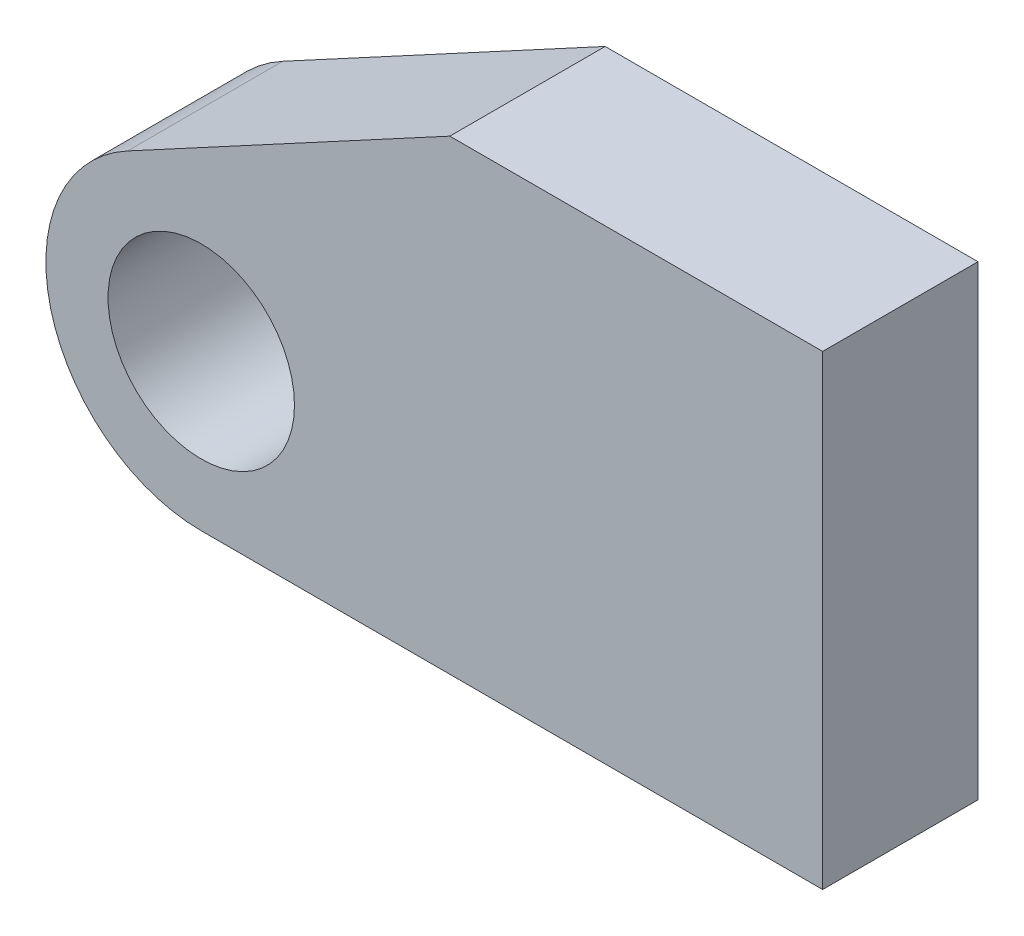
ISO-10303-21;
HEADER;
FILE_DESCRIPTION(('STEP AP214'),'2;1');
FILE_NAME('part.step','',(''),(''),'','','');
FILE_SCHEMA(('AUTOMOTIVE_DESIGN { 1 0 10303 214 1 1 1 1 }'));
ENDSEC;
DATA;
#1=APPLICATION_CONTEXT('core data for automotive mechanical design processes');
#2=APPLICATION_PROTOCOL_DEFINITION('international standard','automotive_design',2000,#1);
#3=PRODUCT_CONTEXT('',#1,'mechanical');
#4=PRODUCT('Part','Part','',(#3));
#5=PRODUCT_RELATED_PRODUCT_CATEGORY('part','',(#4));
#6=PRODUCT_DEFINITION_FORMATION('','',#4);
#7=PRODUCT_DEFINITION_CONTEXT('part definition',#1,'design');
#8=PRODUCT_DEFINITION('design','',#6,#7);
#9=PRODUCT_DEFINITION_SHAPE('','',#8);
#10=(LENGTH_UNIT() NAMED_UNIT(*) SI_UNIT(.MILLI.,.METRE.));
#11=(NAMED_UNIT(*) PLANE_ANGLE_UNIT() SI_UNIT($,.RADIAN.));
#12=(NAMED_UNIT(*) SI_UNIT($,.STERADIAN.) SOLID_ANGLE_UNIT());
#13=UNCERTAINTY_MEASURE_WITH_UNIT(LENGTH_MEASURE(1.E-05),#10,'distance_accuracy_value','');
#14=(GEOMETRIC_REPRESENTATION_CONTEXT(3) GLOBAL_UNCERTAINTY_ASSIGNED_CONTEXT((#13)) GLOBAL_UNIT_ASSIGNED_CONTEXT((#10,
#11,#12)) REPRESENTATION_CONTEXT('',''));
#15=CARTESIAN_POINT('',(0.,0.,0.));
#16=DIRECTION('',(0.,0.,1.));
#17=DIRECTION('',(1.,0.,0.));
#18=AXIS2_PLACEMENT_3D('',#15,#16,#17);
#19=CARTESIAN_POINT('',(0.,0.,49.9999999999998));
#20=DIRECTION('',(0.,0.,1.));
#21=DIRECTION('',(1.,0.,0.));
#22=AXIS2_PLACEMENT_3D('',#19,#20,#21);
#23=PLANE('',#22);
#24=CARTESIAN_POINT('',(0.,0.,49.9999999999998));
#25=DIRECTION('',(0.,0.,1.));
#26=DIRECTION('',(1.,0.,0.));
#27=AXIS2_PLACEMENT_3D('',#24,#25,#26);
#28=CIRCLE('',#27,50.);
#29=CARTESIAN_POINT('',(-23.749469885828,43.9995759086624,49.9999999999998));
#30=VERTEX_POINT('',#29);
#31=CARTESIAN_POINT('',(0.,-49.9999999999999,49.9999999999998));
#32=VERTEX_POINT('',#31);
#33=EDGE_CURVE('E116',#30,#32,#28,.T.);
#34=ORIENTED_EDGE('',*,*,#33,.T.);
#35=DIRECTION('',(1.,0.,0.));
#36=VECTOR('',#35,1.);
#37=CARTESIAN_POINT('',(0.,-49.9999999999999,49.9999999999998));
#38=LINE('',#37,#36);
#39=CARTESIAN_POINT('',(200.,-49.9999999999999,49.9999999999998));
#40=VERTEX_POINT('',#39);
#41=EDGE_CURVE('E83',#32,#40,#38,.T.);
#42=ORIENTED_EDGE('',*,*,#41,.T.);
#43=DIRECTION('',(0.,1.,0.));
#44=VECTOR('',#43,1.);
#45=CARTESIAN_POINT('',(200.,-49.9999999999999,49.9999999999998));
#46=LINE('',#45,#44);
#47=CARTESIAN_POINT('',(200.,100.,49.9999999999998));
#48=VERTEX_POINT('',#47);
#49=EDGE_CURVE('E87',#40,#48,#46,.T.);
#50=ORIENTED_EDGE('',*,*,#49,.T.);
#51=DIRECTION('',(-1.,0.,0.));
#52=VECTOR('',#51,1.);
#53=CARTESIAN_POINT('',(200.,100.,49.9999999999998));
#54=LINE('',#53,#52);
#55=CARTESIAN_POINT('',(80.0000000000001,100.,49.9999999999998));
#56=VERTEX_POINT('',#55);
#57=EDGE_CURVE('E91',#48,#56,#54,.T.);
#58=ORIENTED_EDGE('',*,*,#57,.T.);
#59=DIRECTION('',(-0.879991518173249,-0.47498939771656,0.));
#60=VECTOR('',#59,1.);
#61=CARTESIAN_POINT('',(80.0000000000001,100.,49.9999999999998));
#62=LINE('',#61,#60);
#63=EDGE_CURVE('E49',#56,#30,#62,.T.);
#64=ORIENTED_EDGE('',*,*,#63,.T.);
#65=EDGE_LOOP('',(#34,#42,#50,#58,#64));
#66=FACE_BOUND('',#65,.T.);
#67=CARTESIAN_POINT('',(0.,0.,49.9999999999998));
#68=DIRECTION('',(0.,0.,1.));
#69=DIRECTION('',(1.,0.,0.));
#70=AXIS2_PLACEMENT_3D('',#67,#68,#69);
#71=CIRCLE('',#70,30.);
#72=CARTESIAN_POINT('',(30.,0.,49.9999999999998));
#73=VERTEX_POINT('',#72);
#74=EDGE_CURVE('E111',#73,#73,#71,.T.);
#75=ORIENTED_EDGE('',*,*,#74,.F.);
#76=EDGE_LOOP('',(#75));
#77=FACE_BOUND('',#76,.T.);
#78=ADVANCED_FACE('F32',(#66,#77),#23,.T.);
#79=CARTESIAN_POINT('',(0.,0.,0.));
#80=DIRECTION('',(0.,0.,1.));
#81=DIRECTION('',(1.,0.,0.));
#82=AXIS2_PLACEMENT_3D('',#79,#80,#81);
#83=PLANE('',#82);
#84=CARTESIAN_POINT('',(0.,0.,0.));
#85=DIRECTION('',(0.,0.,1.));
#86=DIRECTION('',(1.,0.,0.));
#87=AXIS2_PLACEMENT_3D('',#84,#85,#86);
#88=CIRCLE('',#87,50.);
#89=CARTESIAN_POINT('',(-23.749469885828,43.9995759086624,0.));
#90=VERTEX_POINT('',#89);
#91=CARTESIAN_POINT('',(0.,-50.,0.));
#92=VERTEX_POINT('',#91);
#93=EDGE_CURVE('E107',#90,#92,#88,.T.);
#94=ORIENTED_EDGE('',*,*,#93,.F.);
#95=DIRECTION('',(-0.879991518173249,-0.47498939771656,0.));
#96=VECTOR('',#95,1.);
#97=CARTESIAN_POINT('',(80.0000000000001,100.,0.));
#98=LINE('',#97,#96);
#99=CARTESIAN_POINT('',(80.0000000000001,100.,0.));
#100=VERTEX_POINT('',#99);
#101=EDGE_CURVE('E75',#100,#90,#98,.T.);
#102=ORIENTED_EDGE('',*,*,#101,.F.);
#103=DIRECTION('',(-1.,0.,0.));
#104=VECTOR('',#103,1.);
#105=CARTESIAN_POINT('',(200.,100.,0.));
#106=LINE('',#105,#104);
#107=CARTESIAN_POINT('',(200.,100.,0.));
#108=VERTEX_POINT('',#107);
#109=EDGE_CURVE('E69',#108,#100,#106,.T.);
#110=ORIENTED_EDGE('',*,*,#109,.F.);
#111=DIRECTION('',(0.,1.,0.));
#112=VECTOR('',#111,1.);
#113=CARTESIAN_POINT('',(200.,-50.,0.));
#114=LINE('',#113,#112);
#115=CARTESIAN_POINT('',(200.,-50.,0.));
#116=VERTEX_POINT('',#115);
#117=EDGE_CURVE('E98',#116,#108,#114,.T.);
#118=ORIENTED_EDGE('',*,*,#117,.F.);
#119=DIRECTION('',(1.,0.,0.));
#120=VECTOR('',#119,1.);
#121=CARTESIAN_POINT('',(0.,-50.,0.));
#122=LINE('',#121,#120);
#123=EDGE_CURVE('E110',#92,#116,#122,.T.);
#124=ORIENTED_EDGE('',*,*,#123,.F.);
#125=EDGE_LOOP('',(#94,#102,#110,#118,#124));
#126=FACE_BOUND('',#125,.T.);
#127=CARTESIAN_POINT('',(0.,0.,0.));
#128=DIRECTION('',(0.,0.,1.));
#129=DIRECTION('',(1.,0.,0.));
#130=AXIS2_PLACEMENT_3D('',#127,#128,#129);
#131=CIRCLE('',#130,30.);
#132=CARTESIAN_POINT('',(30.,0.,0.));
#133=VERTEX_POINT('',#132);
#134=EDGE_CURVE('E196',#133,#133,#131,.T.);
#135=ORIENTED_EDGE('',*,*,#134,.T.);
#136=EDGE_LOOP('',(#135));
#137=FACE_BOUND('',#136,.T.);
#138=ADVANCED_FACE('F120',(#126,#137),#83,.F.);
#139=CARTESIAN_POINT('',(0.,0.,49.9999999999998));
#140=DIRECTION('',(0.,0.,-1.));
#141=DIRECTION('',(-1.,0.,0.));
#142=AXIS2_PLACEMENT_3D('',#139,#140,#141);
#143=CYLINDRICAL_SURFACE('',#142,50.);
#144=ORIENTED_EDGE('',*,*,#93,.T.);
#145=DIRECTION('',(0.,0.,-1.));
#146=VECTOR('',#145,1.);
#147=CARTESIAN_POINT('',(0.,-49.9999999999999,49.9999999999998));
#148=LINE('',#147,#146);
#149=EDGE_CURVE('E11',#32,#92,#148,.T.);
#150=ORIENTED_EDGE('',*,*,#149,.F.);
#151=ORIENTED_EDGE('',*,*,#33,.F.);
#152=DIRECTION('',(0.,0.,-1.));
#153=VECTOR('',#152,1.);
#154=CARTESIAN_POINT('',(-23.749469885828,43.9995759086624,49.9999999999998));
#155=LINE('',#154,#153);
#156=EDGE_CURVE('E103',#30,#90,#155,.T.);
#157=ORIENTED_EDGE('',*,*,#156,.T.);
#158=EDGE_LOOP('',(#144,#150,#151,#157));
#159=FACE_BOUND('',#158,.T.);
#160=ADVANCED_FACE('F34',(#159),#143,.T.);
#161=CARTESIAN_POINT('',(0.,-49.9999999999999,49.9999999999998));
#162=DIRECTION('',(0.,1.,0.));
#163=DIRECTION('',(-1.,0.,0.));
#164=AXIS2_PLACEMENT_3D('',#161,#162,#163);
#165=PLANE('',#164);
#166=ORIENTED_EDGE('',*,*,#123,.T.);
#167=DIRECTION('',(0.,0.,-1.));
#168=VECTOR('',#167,1.);
#169=CARTESIAN_POINT('',(200.,-49.9999999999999,49.9999999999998));
#170=LINE('',#169,#168);
#171=EDGE_CURVE('E41',#40,#116,#170,.T.);
#172=ORIENTED_EDGE('',*,*,#171,.F.);
#173=ORIENTED_EDGE('',*,*,#41,.F.);
#174=ORIENTED_EDGE('',*,*,#149,.T.);
#175=EDGE_LOOP('',(#166,#172,#173,#174));
#176=FACE_BOUND('',#175,.T.);
#177=ADVANCED_FACE('F145',(#176),#165,.F.);
#178=CARTESIAN_POINT('',(200.,-49.9999999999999,49.9999999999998));
#179=DIRECTION('',(-1.,0.,0.));
#180=DIRECTION('',(0.,0.,1.));
#181=AXIS2_PLACEMENT_3D('',#178,#179,#180);
#182=PLANE('',#181);
#183=ORIENTED_EDGE('',*,*,#117,.T.);
#184=DIRECTION('',(0.,0.,-1.));
#185=VECTOR('',#184,1.);
#186=CARTESIAN_POINT('',(200.,100.,49.9999999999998));
#187=LINE('',#186,#185);
#188=EDGE_CURVE('E95',#48,#108,#187,.T.);
#189=ORIENTED_EDGE('',*,*,#188,.F.);
#190=ORIENTED_EDGE('',*,*,#49,.F.);
#191=ORIENTED_EDGE('',*,*,#171,.T.);
#192=EDGE_LOOP('',(#183,#189,#190,#191));
#193=FACE_BOUND('',#192,.T.);
#194=ADVANCED_FACE('F96',(#193),#182,.F.);
#195=CARTESIAN_POINT('',(200.,100.,49.9999999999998));
#196=DIRECTION('',(0.,-1.,0.));
#197=DIRECTION('',(1.,0.,0.));
#198=AXIS2_PLACEMENT_3D('',#195,#196,#197);
#199=PLANE('',#198);
#200=ORIENTED_EDGE('',*,*,#109,.T.);
#201=DIRECTION('',(0.,0.,-1.));
#202=VECTOR('',#201,1.);
#203=CARTESIAN_POINT('',(80.0000000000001,100.,49.9999999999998));
#204=LINE('',#203,#202);
#205=EDGE_CURVE('E99',#56,#100,#204,.T.);
#206=ORIENTED_EDGE('',*,*,#205,.F.);
#207=ORIENTED_EDGE('',*,*,#57,.F.);
#208=ORIENTED_EDGE('',*,*,#188,.T.);
#209=EDGE_LOOP('',(#200,#206,#207,#208));
#210=FACE_BOUND('',#209,.T.);
#211=ADVANCED_FACE('F101',(#210),#199,.F.);
#212=CARTESIAN_POINT('',(80.0000000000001,100.,49.9999999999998));
#213=DIRECTION('',(0.47498939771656,-0.879991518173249,0.));
#214=DIRECTION('',(0.879991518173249,0.47498939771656,0.));
#215=AXIS2_PLACEMENT_3D('',#212,#213,#214);
#216=PLANE('',#215);
#217=ORIENTED_EDGE('',*,*,#101,.T.);
#218=ORIENTED_EDGE('',*,*,#156,.F.);
#219=ORIENTED_EDGE('',*,*,#63,.F.);
#220=ORIENTED_EDGE('',*,*,#205,.T.);
#221=EDGE_LOOP('',(#217,#218,#219,#220));
#222=FACE_BOUND('',#221,.T.);
#223=ADVANCED_FACE('F125',(#222),#216,.F.);
#224=CARTESIAN_POINT('',(0.,0.,49.9999999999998));
#225=DIRECTION('',(0.,0.,-1.));
#226=DIRECTION('',(-1.,0.,0.));
#227=AXIS2_PLACEMENT_3D('',#224,#225,#226);
#228=CYLINDRICAL_SURFACE('',#227,30.);
#229=ORIENTED_EDGE('',*,*,#74,.T.);
#230=EDGE_LOOP('',(#229));
#231=FACE_BOUND('',#230,.T.);
#232=ORIENTED_EDGE('',*,*,#134,.F.);
#233=EDGE_LOOP('',(#232));
#234=FACE_BOUND('',#233,.T.);
#235=ADVANCED_FACE('F127',(#231,#234),#228,.F.);
#236=CLOSED_SHELL('',(#78,#138,#160,#177,#194,#211,#223,#235));
#237=MANIFOLD_SOLID_BREP('B2',#236);
#238=ADVANCED_BREP_SHAPE_REPRESENTATION('',(#18,#237),#14);
#239=SHAPE_DEFINITION_REPRESENTATION(#9,#238);
ENDSEC;
END-ISO-10303-21;
